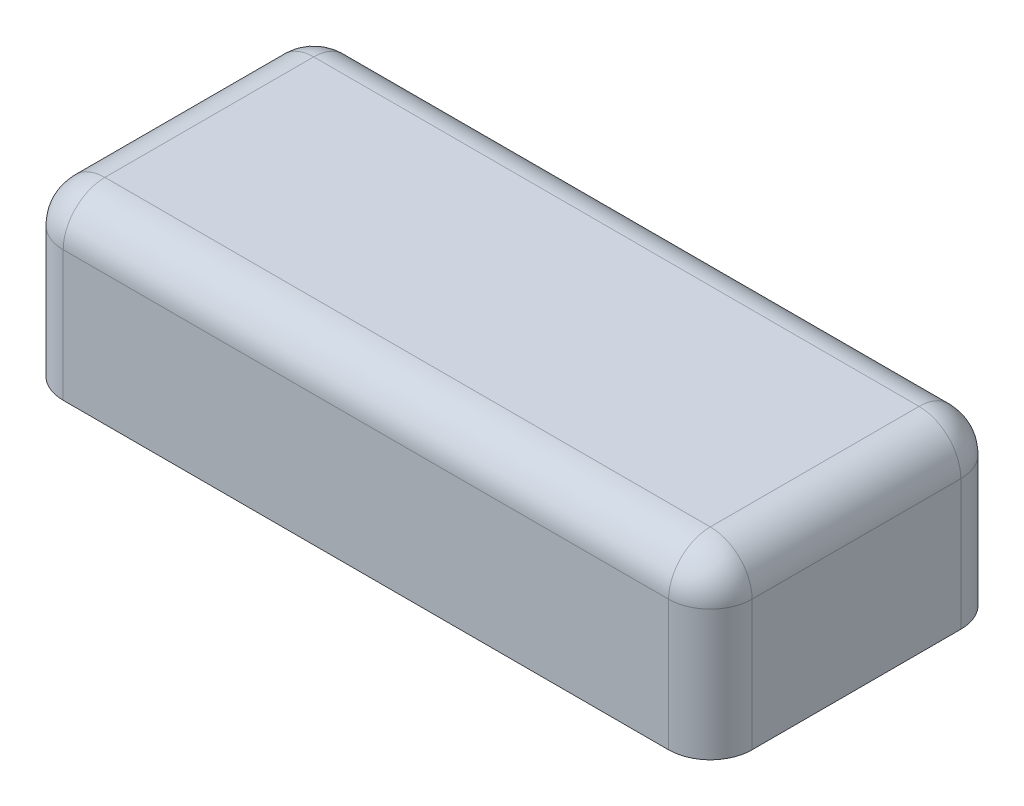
from build123d import *

# Parameters (mm, degrees)
SKETCH1_W           = 66
SKETCH1_H           = 28
SKETCH1_R           = 2
BOSS_EXTRUDE1_DEPTH = 5
SKETCH4_W           = 66
SKETCH4_H           = 28
BOSS_EXTRUDE3_DEPTH = 1
SKETCH5_W           = 66
SKETCH5_H           = 28
SKETCH5_W_2         = 63
SKETCH5_H_2         = 25
BOSS_EXTRUDE4_DEPTH = 9
SKETCH6_W           = 66
SKETCH6_H           = 28
BOSS_EXTRUDE5_DEPTH = 1.5
CUT_EXTRUDE1_REACH  = 41.462
FILLET2_R           = 4


with BuildPart() as part:
    # Sketch1 → Boss-Extrude1 (new body)
    with BuildSketch(Plane(origin=(0, 0, 0), x_dir=(1, 0, 0), z_dir=(0, 1, 0))):
        Rectangle(SKETCH1_W, SKETCH1_H)
        with Locations(Location((-29, 10, 0), (0, 0, 270))):
            Circle(SKETCH1_R, mode=Mode.SUBTRACT)
        with Locations(Location((29, 10, 0), (0, 0, 90))):
            Circle(SKETCH1_R, mode=Mode.SUBTRACT)
        with Locations(Location((29, -10, 0), (0, 0, 270))):
            Circle(SKETCH1_R, mode=Mode.SUBTRACT)
        with Locations(Location((-29, -10, 0), (0, 0, 90))):
            Circle(SKETCH1_R, mode=Mode.SUBTRACT)
    extrude(amount=BOSS_EXTRUDE1_DEPTH)

    # Sketch4 → Boss-Extrude3 (add)
    with BuildSketch(Plane(origin=(0, 5, 0), x_dir=(1, 0, 0), z_dir=(0, 1, 0))):
        Rectangle(SKETCH4_W, SKETCH4_H)
    extrude(amount=BOSS_EXTRUDE3_DEPTH)

    # Sketch5 → Boss-Extrude4 (add)
    with BuildSketch(Plane(origin=(0, 6, 0), x_dir=(1, 0, 0), z_dir=(0, 1, 0))):
        Rectangle(SKETCH5_W, SKETCH5_H)
        Rectangle(SKETCH5_W_2, SKETCH5_H_2, mode=Mode.SUBTRACT)
    extrude(amount=BOSS_EXTRUDE4_DEPTH)

    # Sketch6 → Boss-Extrude5 (add)
    with BuildSketch(Plane(origin=(0, 15, 0), x_dir=(1, 0, 0), z_dir=(0, 1, 0))):
        Rectangle(SKETCH6_W, SKETCH6_H)
    extrude(amount=BOSS_EXTRUDE5_DEPTH)

    # Sketch7 → Cut-Extrude1 (cut, up to next)
    with BuildSketch(Plane.XZ, mode=Mode.PRIVATE) as cut_extrude1_sk1:
        with BuildLine():
            Line((-25.5, 12.5), (25.5, 12.5))
            Line((25.5, 12.5), (25.5, 10))
            ThreePointArc((25.5, 10), (26.525126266, 7.525126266), (29, 6.5))
            Line((29, 6.5), (31.5, 6.5))
            Line((31.5, 6.5), (31.5, 0))
            Line((31.5, 0), (31.5, -6.5))
            Line((31.5, -6.5), (29, -6.5))
            ThreePointArc((29, -6.5), (26.525126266, -7.525126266), (25.5, -10))
            Line((25.5, -10), (25.5, -12.5))
            Line((25.5, -12.5), (-25.5, -12.5))
            Line((-25.5, -12.5), (-25.5, -10))
            ThreePointArc((-25.5, -10), (-26.525126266, -7.525126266), (-29, -6.5))
            Line((-29, -6.5), (-31.5, -6.5))
            Line((-31.5, -6.5), (-31.5, 0))
            Line((-31.5, 0), (-31.5, 6.5))
            Line((-31.5, 6.5), (-29, 6.5))
            ThreePointArc((-29, 6.5), (-26.525126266, 7.525126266), (-25.5, 10))
            Line((-25.5, 10), (-25.5, 12.5))
        make_face()
    cut_extrude1_tool1 = extrude(cut_extrude1_sk1.sketch, amount=-CUT_EXTRUDE1_REACH, mode=Mode.PRIVATE) & part.part
    add(cut_extrude1_tool1.solids().sort_by_distance((0, 0, 0))[0], mode=Mode.SUBTRACT)

    # Fillet2
    fillet2_edges = [part.edges().sort_by_distance(p)[0] for p in [
        (31.5, 15, 0),
        (0, 15, -12.5),
        (-31.5, 15, 0),
        (0, 15, 12.5),
        (0, 16.5, -14),
        (-33, 16.5, 0),
        (0, 16.5, 14),
        (33, 16.5, 0),
        (33, 8.25, 14),
        (-33, 8.25, 14),
        (-33, 8.25, -14),
        (33, 8.25, -14),
    ]]
    fillet(fillet2_edges, radius=FILLET2_R)


solid = part.part
